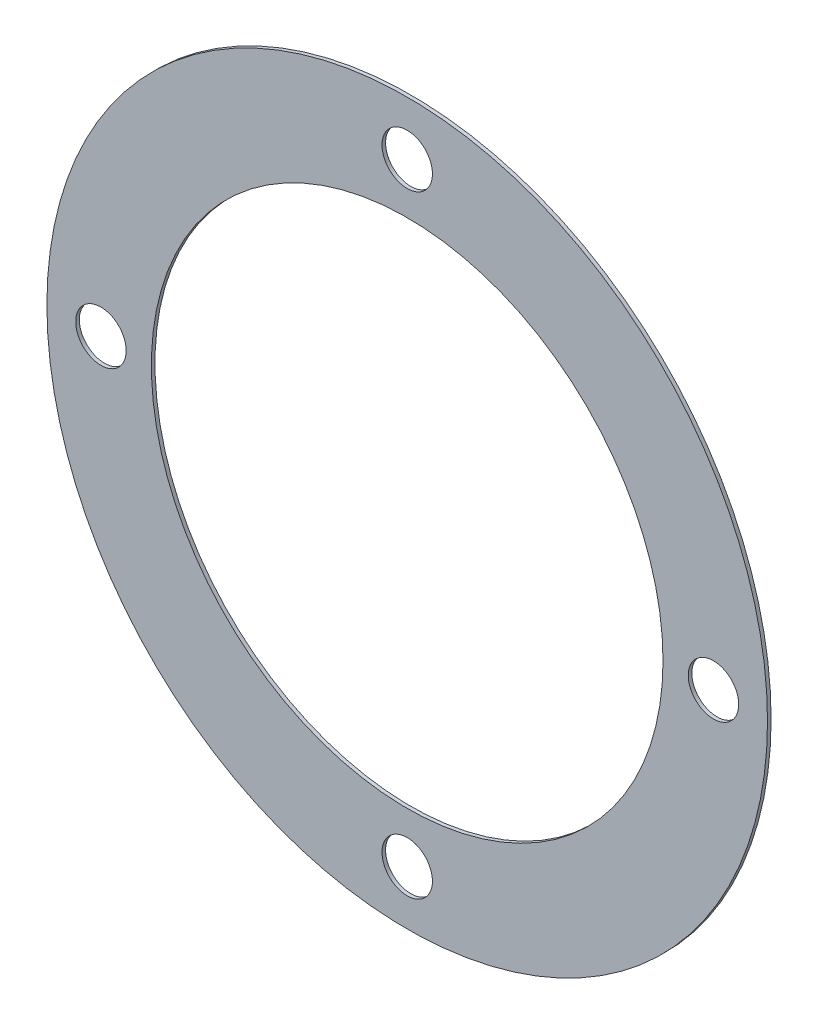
from build123d import *

# Parameters (mm, degrees)
ESQUISSE1_R          = 3.5
ESQUISSE1_R_2        = 35.5
BASE_EXTRUSION_DEPTH = 0.5


with BuildPart() as part:
    # Esquisse1 → Base-Extrusion (new body)
    with BuildSketch(Plane.XY):
        with BuildLine():
            ThreePointArc((-49.999773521, -0.150492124), (0, -50), (49.999773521, -0.150492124))
            ThreePointArc((49.999773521, -0.150492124), (0, 50), (-49.999773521, -0.150492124))
        make_face()
        with Locations((0, -42.5)):
            Circle(ESQUISSE1_R, mode=Mode.SUBTRACT)
        with Locations((-42.5, 0)):
            Circle(ESQUISSE1_R, mode=Mode.SUBTRACT)
        with Locations((0, 42.5)):
            Circle(ESQUISSE1_R, mode=Mode.SUBTRACT)
        with Locations((42.5, 0)):
            Circle(ESQUISSE1_R, mode=Mode.SUBTRACT)
        Circle(ESQUISSE1_R_2, mode=Mode.SUBTRACT)
    extrude(amount=BASE_EXTRUSION_DEPTH)


solid = part.part
